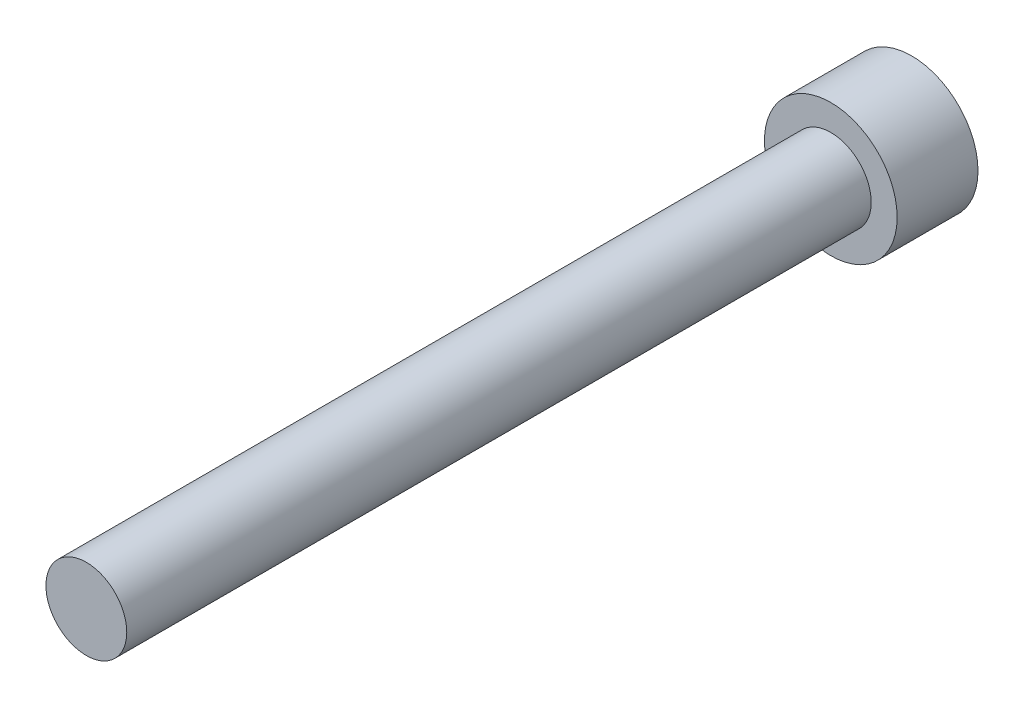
ISO-10303-21;
HEADER;
FILE_DESCRIPTION(('STEP AP214'),'2;1');
FILE_NAME('part.step','',(''),(''),'','','');
FILE_SCHEMA(('AUTOMOTIVE_DESIGN { 1 0 10303 214 1 1 1 1 }'));
ENDSEC;
DATA;
#1=APPLICATION_CONTEXT('core data for automotive mechanical design processes');
#2=APPLICATION_PROTOCOL_DEFINITION('international standard','automotive_design',2000,#1);
#3=PRODUCT_CONTEXT('',#1,'mechanical');
#4=PRODUCT('Part','Part','',(#3));
#5=PRODUCT_RELATED_PRODUCT_CATEGORY('part','',(#4));
#6=PRODUCT_DEFINITION_FORMATION('','',#4);
#7=PRODUCT_DEFINITION_CONTEXT('part definition',#1,'design');
#8=PRODUCT_DEFINITION('design','',#6,#7);
#9=PRODUCT_DEFINITION_SHAPE('','',#8);
#10=(LENGTH_UNIT() NAMED_UNIT(*) SI_UNIT(.MILLI.,.METRE.));
#11=(NAMED_UNIT(*) PLANE_ANGLE_UNIT() SI_UNIT($,.RADIAN.));
#12=(NAMED_UNIT(*) SI_UNIT($,.STERADIAN.) SOLID_ANGLE_UNIT());
#13=UNCERTAINTY_MEASURE_WITH_UNIT(LENGTH_MEASURE(1.E-05),#10,'distance_accuracy_value','');
#14=(GEOMETRIC_REPRESENTATION_CONTEXT(3) GLOBAL_UNCERTAINTY_ASSIGNED_CONTEXT((#13)) GLOBAL_UNIT_ASSIGNED_CONTEXT((#10,
#11,#12)) REPRESENTATION_CONTEXT('',''));
#15=CARTESIAN_POINT('',(0.,0.,0.));
#16=DIRECTION('',(0.,0.,1.));
#17=DIRECTION('',(1.,0.,0.));
#18=AXIS2_PLACEMENT_3D('',#15,#16,#17);
#19=CARTESIAN_POINT('',(0.,0.,44.45));
#20=DIRECTION('',(0.,0.,1.));
#21=DIRECTION('',(1.,0.,0.));
#22=AXIS2_PLACEMENT_3D('',#19,#20,#21);
#23=PLANE('',#22);
#24=CARTESIAN_POINT('',(0.,0.,44.45));
#25=DIRECTION('',(0.,0.,1.));
#26=DIRECTION('',(1.,0.,0.));
#27=AXIS2_PLACEMENT_3D('',#24,#25,#26);
#28=CIRCLE('',#27,2.413);
#29=CARTESIAN_POINT('',(2.413,0.,44.45));
#30=VERTEX_POINT('',#29);
#31=EDGE_CURVE('E11',#30,#30,#28,.T.);
#32=ORIENTED_EDGE('',*,*,#31,.T.);
#33=EDGE_LOOP('',(#32));
#34=FACE_BOUND('',#33,.T.);
#35=ADVANCED_FACE('F37',(#34),#23,.T.);
#36=CARTESIAN_POINT('',(0.,0.,44.45));
#37=DIRECTION('',(0.,0.,1.));
#38=DIRECTION('',(1.,0.,0.));
#39=AXIS2_PLACEMENT_3D('',#36,#37,#38);
#40=CYLINDRICAL_SURFACE('',#39,2.413);
#41=CARTESIAN_POINT('',(0.,0.,0.));
#42=DIRECTION('',(0.,0.,1.));
#43=DIRECTION('',(1.,0.,0.));
#44=AXIS2_PLACEMENT_3D('',#41,#42,#43);
#45=CIRCLE('',#44,2.413);
#46=CARTESIAN_POINT('',(2.413,0.,0.));
#47=VERTEX_POINT('',#46);
#48=EDGE_CURVE('E44',#47,#47,#45,.T.);
#49=ORIENTED_EDGE('',*,*,#48,.T.);
#50=EDGE_LOOP('',(#49));
#51=FACE_BOUND('',#50,.T.);
#52=ORIENTED_EDGE('',*,*,#31,.F.);
#53=EDGE_LOOP('',(#52));
#54=FACE_BOUND('',#53,.T.);
#55=ADVANCED_FACE('F151',(#51,#54),#40,.T.);
#56=CARTESIAN_POINT('',(0.,-2.413,0.));
#57=DIRECTION('',(0.,0.,1.));
#58=DIRECTION('',(1.,0.,0.));
#59=AXIS2_PLACEMENT_3D('',#56,#57,#58);
#60=PLANE('',#59);
#61=CARTESIAN_POINT('',(0.,0.,0.));
#62=DIRECTION('',(0.,0.,1.));
#63=DIRECTION('',(1.,0.,0.));
#64=AXIS2_PLACEMENT_3D('',#61,#62,#63);
#65=CIRCLE('',#64,3.9624);
#66=CARTESIAN_POINT('',(3.9624,0.,0.));
#67=VERTEX_POINT('',#66);
#68=EDGE_CURVE('E146',#67,#67,#65,.T.);
#69=ORIENTED_EDGE('',*,*,#68,.T.);
#70=EDGE_LOOP('',(#69));
#71=FACE_BOUND('',#70,.T.);
#72=ORIENTED_EDGE('',*,*,#48,.F.);
#73=EDGE_LOOP('',(#72));
#74=FACE_BOUND('',#73,.T.);
#75=ADVANCED_FACE('F154',(#71,#74),#60,.T.);
#76=CARTESIAN_POINT('',(0.,0.,44.45));
#77=DIRECTION('',(0.,0.,1.));
#78=DIRECTION('',(1.,0.,0.));
#79=AXIS2_PLACEMENT_3D('',#76,#77,#78);
#80=CYLINDRICAL_SURFACE('',#79,3.9624);
#81=CARTESIAN_POINT('',(0.,0.,-4.826));
#82=DIRECTION('',(0.,0.,1.));
#83=DIRECTION('',(1.,0.,0.));
#84=AXIS2_PLACEMENT_3D('',#81,#82,#83);
#85=CIRCLE('',#84,3.9624);
#86=CARTESIAN_POINT('',(3.9624,0.,-4.826));
#87=VERTEX_POINT('',#86);
#88=EDGE_CURVE('E138',#87,#87,#85,.T.);
#89=ORIENTED_EDGE('',*,*,#88,.T.);
#90=EDGE_LOOP('',(#89));
#91=FACE_BOUND('',#90,.T.);
#92=ORIENTED_EDGE('',*,*,#68,.F.);
#93=EDGE_LOOP('',(#92));
#94=FACE_BOUND('',#93,.T.);
#95=ADVANCED_FACE('F156',(#91,#94),#80,.T.);
#96=CARTESIAN_POINT('',(0.,-3.9624,-4.826));
#97=DIRECTION('',(0.,0.,-1.));
#98=DIRECTION('',(-1.,0.,0.));
#99=AXIS2_PLACEMENT_3D('',#96,#97,#98);
#100=PLANE('',#99);
#101=DIRECTION('',(0.866025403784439,-0.5,0.));
#102=VECTOR('',#101,1.);
#103=CARTESIAN_POINT('',(0.,2.28769270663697,-4.826));
#104=LINE('',#103,#102);
#105=CARTESIAN_POINT('',(0.,2.28769270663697,-4.826));
#106=VERTEX_POINT('',#105);
#107=CARTESIAN_POINT('',(1.9812,1.14384635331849,-4.826));
#108=VERTEX_POINT('',#107);
#109=EDGE_CURVE('E51',#106,#108,#104,.T.);
#110=ORIENTED_EDGE('',*,*,#109,.F.);
#111=DIRECTION('',(0.866025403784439,0.5,0.));
#112=VECTOR('',#111,1.);
#113=CARTESIAN_POINT('',(-1.9812,1.14384635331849,-4.826));
#114=LINE('',#113,#112);
#115=CARTESIAN_POINT('',(-1.9812,1.14384635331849,-4.826));
#116=VERTEX_POINT('',#115);
#117=EDGE_CURVE('E134',#116,#106,#114,.T.);
#118=ORIENTED_EDGE('',*,*,#117,.F.);
#119=DIRECTION('',(0.,1.,0.));
#120=VECTOR('',#119,1.);
#121=CARTESIAN_POINT('',(-1.9812,-1.14384635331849,-4.826));
#122=LINE('',#121,#120);
#123=CARTESIAN_POINT('',(-1.9812,-1.14384635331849,-4.826));
#124=VERTEX_POINT('',#123);
#125=EDGE_CURVE('E132',#124,#116,#122,.T.);
#126=ORIENTED_EDGE('',*,*,#125,.F.);
#127=DIRECTION('',(-0.866025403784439,0.5,0.));
#128=VECTOR('',#127,1.);
#129=CARTESIAN_POINT('',(0.,-2.28769270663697,-4.826));
#130=LINE('',#129,#128);
#131=CARTESIAN_POINT('',(0.,-2.28769270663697,-4.826));
#132=VERTEX_POINT('',#131);
#133=EDGE_CURVE('E99',#132,#124,#130,.T.);
#134=ORIENTED_EDGE('',*,*,#133,.F.);
#135=DIRECTION('',(-0.866025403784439,-0.5,0.));
#136=VECTOR('',#135,1.);
#137=CARTESIAN_POINT('',(1.9812,-1.14384635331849,-4.826));
#138=LINE('',#137,#136);
#139=CARTESIAN_POINT('',(1.9812,-1.14384635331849,-4.826));
#140=VERTEX_POINT('',#139);
#141=EDGE_CURVE('E128',#140,#132,#138,.T.);
#142=ORIENTED_EDGE('',*,*,#141,.F.);
#143=DIRECTION('',(0.,-1.,0.));
#144=VECTOR('',#143,1.);
#145=CARTESIAN_POINT('',(1.9812,1.14384635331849,-4.826));
#146=LINE('',#145,#144);
#147=EDGE_CURVE('E125',#108,#140,#146,.T.);
#148=ORIENTED_EDGE('',*,*,#147,.F.);
#149=EDGE_LOOP('',(#110,#118,#126,#134,#142,#148));
#150=FACE_BOUND('',#149,.T.);
#151=ORIENTED_EDGE('',*,*,#88,.F.);
#152=EDGE_LOOP('',(#151));
#153=FACE_BOUND('',#152,.T.);
#154=ADVANCED_FACE('F163',(#150,#153),#100,.T.);
#155=CARTESIAN_POINT('',(0.,2.28769270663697,-1.778));
#156=DIRECTION('',(0.5,0.866025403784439,0.));
#157=DIRECTION('',(-0.866025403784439,0.5,0.));
#158=AXIS2_PLACEMENT_3D('',#155,#156,#157);
#159=PLANE('',#158);
#160=ORIENTED_EDGE('',*,*,#109,.T.);
#161=DIRECTION('',(0.,0.,-1.));
#162=VECTOR('',#161,1.);
#163=CARTESIAN_POINT('',(1.9812,1.14384635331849,-1.778));
#164=LINE('',#163,#162);
#165=CARTESIAN_POINT('',(1.9812,1.14384635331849,-1.778));
#166=VERTEX_POINT('',#165);
#167=EDGE_CURVE('E81',#166,#108,#164,.T.);
#168=ORIENTED_EDGE('',*,*,#167,.F.);
#169=DIRECTION('',(0.866025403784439,-0.5,0.));
#170=VECTOR('',#169,1.);
#171=CARTESIAN_POINT('',(0.,2.28769270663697,-1.778));
#172=LINE('',#171,#170);
#173=CARTESIAN_POINT('',(0.,2.28769270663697,-1.778));
#174=VERTEX_POINT('',#173);
#175=EDGE_CURVE('E136',#174,#166,#172,.T.);
#176=ORIENTED_EDGE('',*,*,#175,.F.);
#177=DIRECTION('',(0.,0.,-1.));
#178=VECTOR('',#177,1.);
#179=CARTESIAN_POINT('',(0.,2.28769270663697,-1.778));
#180=LINE('',#179,#178);
#181=EDGE_CURVE('E59',#174,#106,#180,.T.);
#182=ORIENTED_EDGE('',*,*,#181,.T.);
#183=EDGE_LOOP('',(#160,#168,#176,#182));
#184=FACE_BOUND('',#183,.T.);
#185=ADVANCED_FACE('F197',(#184),#159,.F.);
#186=CARTESIAN_POINT('',(-1.9812,1.14384635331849,-1.778));
#187=DIRECTION('',(-0.5,0.866025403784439,0.));
#188=DIRECTION('',(-0.866025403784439,-0.5,0.));
#189=AXIS2_PLACEMENT_3D('',#186,#187,#188);
#190=PLANE('',#189);
#191=ORIENTED_EDGE('',*,*,#117,.T.);
#192=ORIENTED_EDGE('',*,*,#181,.F.);
#193=DIRECTION('',(0.866025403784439,0.5,0.));
#194=VECTOR('',#193,1.);
#195=CARTESIAN_POINT('',(-1.9812,1.14384635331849,-1.778));
#196=LINE('',#195,#194);
#197=CARTESIAN_POINT('',(-1.9812,1.14384635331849,-1.778));
#198=VERTEX_POINT('',#197);
#199=EDGE_CURVE('E111',#198,#174,#196,.T.);
#200=ORIENTED_EDGE('',*,*,#199,.F.);
#201=DIRECTION('',(0.,0.,-1.));
#202=VECTOR('',#201,1.);
#203=CARTESIAN_POINT('',(-1.9812,1.14384635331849,-1.778));
#204=LINE('',#203,#202);
#205=EDGE_CURVE('E103',#198,#116,#204,.T.);
#206=ORIENTED_EDGE('',*,*,#205,.T.);
#207=EDGE_LOOP('',(#191,#192,#200,#206));
#208=FACE_BOUND('',#207,.T.);
#209=ADVANCED_FACE('F208',(#208),#190,.F.);
#210=CARTESIAN_POINT('',(-1.9812,-1.14384635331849,-1.778));
#211=DIRECTION('',(-1.,0.,0.));
#212=DIRECTION('',(0.,-1.,0.));
#213=AXIS2_PLACEMENT_3D('',#210,#211,#212);
#214=PLANE('',#213);
#215=ORIENTED_EDGE('',*,*,#125,.T.);
#216=ORIENTED_EDGE('',*,*,#205,.F.);
#217=DIRECTION('',(0.,1.,0.));
#218=VECTOR('',#217,1.);
#219=CARTESIAN_POINT('',(-1.9812,-1.14384635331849,-1.778));
#220=LINE('',#219,#218);
#221=CARTESIAN_POINT('',(-1.9812,-1.14384635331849,-1.778));
#222=VERTEX_POINT('',#221);
#223=EDGE_CURVE('E107',#222,#198,#220,.T.);
#224=ORIENTED_EDGE('',*,*,#223,.F.);
#225=DIRECTION('',(0.,0.,-1.));
#226=VECTOR('',#225,1.);
#227=CARTESIAN_POINT('',(-1.9812,-1.14384635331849,-1.778));
#228=LINE('',#227,#226);
#229=EDGE_CURVE('E92',#222,#124,#228,.T.);
#230=ORIENTED_EDGE('',*,*,#229,.T.);
#231=EDGE_LOOP('',(#215,#216,#224,#230));
#232=FACE_BOUND('',#231,.T.);
#233=ADVANCED_FACE('F108',(#232),#214,.F.);
#234=CARTESIAN_POINT('',(0.,-2.28769270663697,-1.778));
#235=DIRECTION('',(-0.5,-0.866025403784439,0.));
#236=DIRECTION('',(0.866025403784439,-0.5,0.));
#237=AXIS2_PLACEMENT_3D('',#234,#235,#236);
#238=PLANE('',#237);
#239=ORIENTED_EDGE('',*,*,#133,.T.);
#240=ORIENTED_EDGE('',*,*,#229,.F.);
#241=DIRECTION('',(-0.866025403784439,0.5,0.));
#242=VECTOR('',#241,1.);
#243=CARTESIAN_POINT('',(0.,-2.28769270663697,-1.778));
#244=LINE('',#243,#242);
#245=CARTESIAN_POINT('',(0.,-2.28769270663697,-1.778));
#246=VERTEX_POINT('',#245);
#247=EDGE_CURVE('E96',#246,#222,#244,.T.);
#248=ORIENTED_EDGE('',*,*,#247,.F.);
#249=DIRECTION('',(0.,0.,-1.));
#250=VECTOR('',#249,1.);
#251=CARTESIAN_POINT('',(0.,-2.28769270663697,-1.778));
#252=LINE('',#251,#250);
#253=EDGE_CURVE('E104',#246,#132,#252,.T.);
#254=ORIENTED_EDGE('',*,*,#253,.T.);
#255=EDGE_LOOP('',(#239,#240,#248,#254));
#256=FACE_BOUND('',#255,.T.);
#257=ADVANCED_FACE('F94',(#256),#238,.F.);
#258=CARTESIAN_POINT('',(1.9812,-1.14384635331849,-1.778));
#259=DIRECTION('',(0.5,-0.866025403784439,0.));
#260=DIRECTION('',(0.866025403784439,0.5,0.));
#261=AXIS2_PLACEMENT_3D('',#258,#259,#260);
#262=PLANE('',#261);
#263=ORIENTED_EDGE('',*,*,#141,.T.);
#264=ORIENTED_EDGE('',*,*,#253,.F.);
#265=DIRECTION('',(-0.866025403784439,-0.5,0.));
#266=VECTOR('',#265,1.);
#267=CARTESIAN_POINT('',(1.9812,-1.14384635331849,-1.778));
#268=LINE('',#267,#266);
#269=CARTESIAN_POINT('',(1.9812,-1.14384635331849,-1.778));
#270=VERTEX_POINT('',#269);
#271=EDGE_CURVE('E117',#270,#246,#268,.T.);
#272=ORIENTED_EDGE('',*,*,#271,.F.);
#273=DIRECTION('',(0.,0.,-1.));
#274=VECTOR('',#273,1.);
#275=CARTESIAN_POINT('',(1.9812,-1.14384635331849,-1.778));
#276=LINE('',#275,#274);
#277=EDGE_CURVE('E141',#270,#140,#276,.T.);
#278=ORIENTED_EDGE('',*,*,#277,.T.);
#279=EDGE_LOOP('',(#263,#264,#272,#278));
#280=FACE_BOUND('',#279,.T.);
#281=ADVANCED_FACE('F236',(#280),#262,.F.);
#282=CARTESIAN_POINT('',(1.9812,1.14384635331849,-1.778));
#283=DIRECTION('',(1.,0.,0.));
#284=DIRECTION('',(0.,0.,-1.));
#285=AXIS2_PLACEMENT_3D('',#282,#283,#284);
#286=PLANE('',#285);
#287=ORIENTED_EDGE('',*,*,#147,.T.);
#288=ORIENTED_EDGE('',*,*,#277,.F.);
#289=DIRECTION('',(0.,-1.,0.));
#290=VECTOR('',#289,1.);
#291=CARTESIAN_POINT('',(1.9812,1.14384635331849,-1.778));
#292=LINE('',#291,#290);
#293=EDGE_CURVE('E119',#166,#270,#292,.T.);
#294=ORIENTED_EDGE('',*,*,#293,.F.);
#295=ORIENTED_EDGE('',*,*,#167,.T.);
#296=EDGE_LOOP('',(#287,#288,#294,#295));
#297=FACE_BOUND('',#296,.T.);
#298=ADVANCED_FACE('F246',(#297),#286,.F.);
#299=CARTESIAN_POINT('',(3.9624,0.,-1.778));
#300=DIRECTION('',(0.,0.,-1.));
#301=DIRECTION('',(-1.,0.,0.));
#302=AXIS2_PLACEMENT_3D('',#299,#300,#301);
#303=PLANE('',#302);
#304=ORIENTED_EDGE('',*,*,#175,.T.);
#305=ORIENTED_EDGE('',*,*,#293,.T.);
#306=ORIENTED_EDGE('',*,*,#271,.T.);
#307=ORIENTED_EDGE('',*,*,#247,.T.);
#308=ORIENTED_EDGE('',*,*,#223,.T.);
#309=ORIENTED_EDGE('',*,*,#199,.T.);
#310=EDGE_LOOP('',(#304,#305,#306,#307,#308,#309));
#311=FACE_BOUND('',#310,.T.);
#312=ADVANCED_FACE('F114',(#311),#303,.T.);
#313=CLOSED_SHELL('',(#35,#55,#75,#95,#154,#185,#209,#233,#257,#281,#298,#312));
#314=MANIFOLD_SOLID_BREP('B2',#313);
#315=ADVANCED_BREP_SHAPE_REPRESENTATION('',(#18,#314),#14);
#316=SHAPE_DEFINITION_REPRESENTATION(#9,#315);
ENDSEC;
END-ISO-10303-21;
